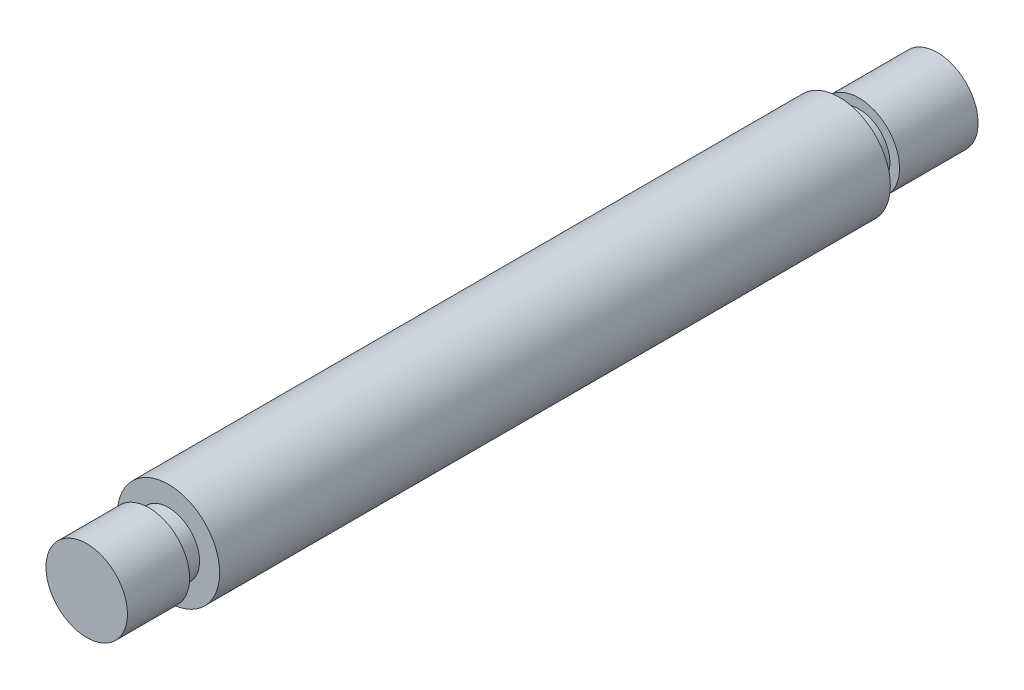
from build123d import *

# Parameters (mm, degrees)
SKETCH1_R      = 7.62
EXTRUDE1_DEPTH = 6.35
SKETCH2_R      = 3.96875
EXTRUDE2_DEPTH = 59.69


with BuildPart() as part:
    # Sketch1 → Extrude1 (new body)
    with BuildSketch(Plane.XY):
        Circle(SKETCH1_R)
    extrude(amount=EXTRUDE1_DEPTH)

    # Sketch2 → Extrude2 (add)
    with BuildSketch(Plane(origin=(0, 0, 0), x_dir=(-1, 0, 0), z_dir=(0, 0, -1))):
        with Locations(Location((0, 0, 0), (0, 0, 180))):
            Circle(SKETCH2_R)
    extrude(amount=EXTRUDE2_DEPTH)

    # Sketch6 → 1_4-28 Thread 1 (revolve, cut)
    with BuildSketch(Plane(origin=(0, 0, 0), x_dir=(1, 0, 0), z_dir=(0, 1, 0)), mode=Mode.PRIVATE) as f_1_4_28_thread_1_sk:
        Polygon((3.96875, 52.07), (2.413, 52.07), (2.413, 53.594), (3.1623, 53.594), (3.1623, 59.69), (3.96875, 59.69), align=None)
    revolve(f_1_4_28_thread_1_sk.sketch.rotate(Axis((0, 0, -59.69), (0, 0, 1)), 180), axis=Axis((0, 0, -59.69), (0, 0, 1)), mode=Mode.SUBTRACT)

    # Sketch7 → 1_4-28 Thread 2 (revolve, cut)
    with BuildSketch(Plane(origin=(0, 0, 0), x_dir=(1, 0, 0), z_dir=(0, 1, 0)), mode=Mode.PRIVATE) as f_1_4_28_thread_2_sk:
        Polygon((7.62, -6.35), (7.62, 0), (2.413, 0), (2.413, -1.524), (3.1623, -1.524), (3.1623, -6.35), align=None)
    revolve(f_1_4_28_thread_2_sk.sketch.rotate(Axis((0, 0, 0), (0, 0, 1)), 180), axis=Axis((0, 0, 0), (0, 0, 1)), mode=Mode.SUBTRACT)


solid = part.part
